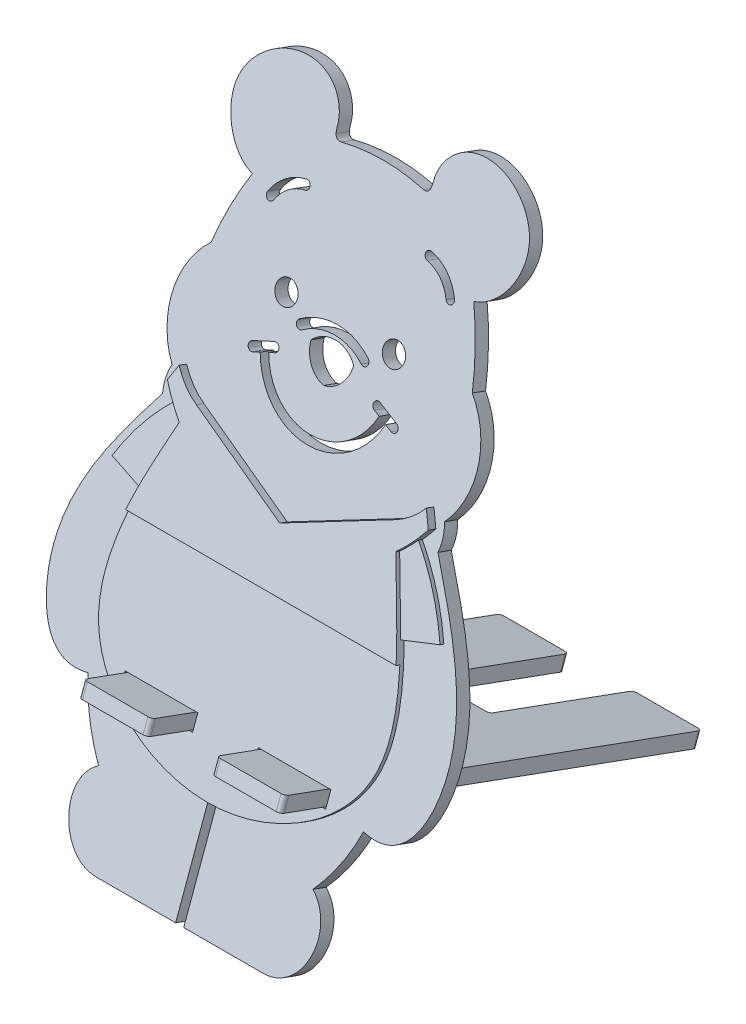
from build123d import *

# Parameters (mm, degrees)
EXTRUDE_1_DEPTH     = 3.5
FILLET_1_R          = 1
EXTRUDE_2_DEPTH     = 3.5
SKETCH_6_W          = 18
SKETCH_6_H          = 3.8
CUT_EXTRUDE_1_DEPTH = 189.194168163
SKETCH_8_R          = 2.733168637
CUT_EXTRUDE_3_DEPTH = 189.194168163
SKETCH_9_W          = 18
SKETCH_9_H          = 3.8
EXTRUDE_3_DEPTH     = 2
SKETCH_10_W         = 97.813131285
SKETCH_10_H         = 48.202311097
CUT_EXTRUDE_4_DEPTH = 1
EXTRUDE_5_DEPTH     = 1
CUT_EXTRUDE_5_DEPTH = 189.194168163


with BuildPart() as part:
    # Sketch 4 → Extrude 1 (new body)
    with BuildSketch(Plane(origin=(0, 32.139380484, -11.697777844), x_dir=(0, -0.34202014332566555, -0.9396926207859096), z_dir=(0, -0.9396926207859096, 0.34202014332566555))):
        Polygon((-16.030737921, -25), (93.969262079, -25), (93.969262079, -8), (55.969262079, -8), (55.969262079, 8), (93.969262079, 8), (93.969262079, 25), (-16.030737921, 25), (-16.030737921, 8), (0, 8), (0, -8), (-16.030737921, -8), align=None)
    extrude(amount=-EXTRUDE_1_DEPTH)

    # Fillet 1
    fillet_1_edges = [part.edges().sort_by_distance(p)[0] for p in [
        (-8, 39.266677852, 2.767653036),
        (-8, 33.783842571, -12.296313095),
        (8, 33.783842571, -12.296313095),
        (8, 39.266677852, 2.767653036),
        (25, 39.266677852, 2.767653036),
        (25, 1.644462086, -100.598535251),
        (8, 1.644462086, -100.598535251),
        (8, 14.641227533, -64.890215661),
        (-8, 14.641227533, -64.890215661),
        (-8, 1.644462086, -100.598535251),
        (-25, 1.644462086, -100.598535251),
        (-25, 39.266677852, 2.767653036),
    ]]
    fillet(fillet_1_edges, radius=FILLET_1_R)


with BuildPart() as body_2:
    # Sketch 5 → Extrude 2 (new body)
    with BuildSketch(Plane(origin=(0, 0, 0), x_dir=(0, 0.9396926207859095, -0.34202014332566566), z_dir=(0, -0.34202014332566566, -0.9396926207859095))):
        with BuildLine():
            Line((0, -20.658830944), (0, 20.658830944))
            add(Edge.make_bspline(
                [(18.883094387, 26.559790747), (13.900612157, 34.189685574), (0, 30.301471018), (0, 20.658830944)],
                knots=[0, 0, 0, 0, 1, 1, 1, 1], degree=3))
            ThreePointArc((18.883094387, 26.559790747), (25.771840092, 31.090114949), (33.434749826, 34.132888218))
            add(Edge.make_bspline(
                [(33.434749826, 34.132888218), (31.242065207, 43.568046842), (55.322218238, 55.363141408), (75.824445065, 41.637903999), (87.433341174, 34.132888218)],
                knots=[0, 0, 0, 0, 0.341997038, 1, 1, 1, 1], degree=3))
            ThreePointArc((87.433341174, 34.132888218), (90.334546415, 34.386280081), (93.180693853, 33.769316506))
            ThreePointArc((93.180693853, 33.769316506), (105.584070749, 37.86009381), (117.436898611, 32.374778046))
            ThreePointArc((117.436898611, 32.374778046), (125.335294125, 30.395019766), (132.921370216, 27.4360429))
            add(Edge.make_bspline(
                [(147.712565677, 11.753616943), (148.409020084, 11.947401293), (151.491552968, 11.674076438), (157.796485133, 15.441255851), (159.401807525, 27.199265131), (147.74878741, 40.745720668), (134.496232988, 33.363407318), (132.921370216, 27.4360429)],
                knots=[0.065882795, 0.065882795, 0.065882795, 0.065882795, 0.103766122, 0.230181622, 0.40921719, 0.672978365, 1, 1, 1, 1], degree=3))
            ThreePointArc((147.712565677, 11.753616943), (146.950478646, 11.176947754), (146.788573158, 10.235082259))
            ThreePointArc((146.788573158, 10.235082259), (147.847352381, 0), (146.788573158, -10.235082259))
            ThreePointArc((146.788573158, -10.235082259), (146.950478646, -11.176947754), (147.712565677, -11.753616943))
            add(Edge.make_bspline(
                [(147.712565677, -11.753616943), (148.409020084, -11.947401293), (151.491552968, -11.674076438), (157.796485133, -15.441255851), (159.401807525, -27.199265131), (147.74878741, -40.745720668), (134.496232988, -33.363407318), (132.921370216, -27.4360429)],
                knots=[0.065882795, 0.065882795, 0.065882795, 0.065882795, 0.103766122, 0.230181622, 0.40921719, 0.672978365, 1, 1, 1, 1], degree=3))
            ThreePointArc((132.921370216, -27.4360429), (125.335294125, -30.395019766), (117.436898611, -32.374778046))
            ThreePointArc((117.436898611, -32.374778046), (105.584070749, -37.86009381), (93.180693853, -33.769316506))
            ThreePointArc((93.180693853, -33.769316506), (90.334546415, -34.386280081), (87.433341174, -34.132888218))
            add(Edge.make_bspline(
                [(33.434749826, -34.132888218), (31.242065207, -43.568046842), (55.322218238, -55.363141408), (75.824445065, -41.637903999), (87.433341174, -34.132888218)],
                knots=[0, 0, 0, 0, 0.341997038, 1, 1, 1, 1], degree=3))
            ThreePointArc((33.434749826, -34.132888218), (25.771840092, -31.090114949), (18.883094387, -26.559790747))
            add(Edge.make_bspline(
                [(18.883094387, -26.559790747), (13.900612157, -34.189685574), (0, -30.301471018), (0, -20.658830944)],
                knots=[0, 0, 0, 0, 1, 1, 1, 1], degree=3))
        make_face()
    extrude(amount=-EXTRUDE_2_DEPTH)

    # Sketch 6 → Cut-Extrude 1 (cut, through all)
    with BuildSketch(Plane(origin=(0, 1.197070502, 3.288924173), x_dir=(1, 0, 0), z_dir=(0, 0.3420201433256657, 0.9396926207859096))):
        with Locations((16.5, 35.9)):
            Rectangle(SKETCH_6_W, SKETCH_6_H)
        with Locations((-16.5, 35.9)):
            Rectangle(SKETCH_6_W, SKETCH_6_H)
    extrude(amount=-CUT_EXTRUDE_1_DEPTH, mode=Mode.SUBTRACT)

    # Sketch 8 → Cut-Extrude 3 (cut, through all)
    with BuildSketch(Plane(origin=(0, 1.197070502, 3.288924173), x_dir=(1, 0, 0), z_dir=(0, 0.34202014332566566, 0.9396926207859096))):
        with Locations(Location((13.325965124, 116.351655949, 0), (0, 0, 270))):
            Circle(SKETCH_8_R)
        with Locations(Location((-13.325965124, 116.351655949, 0), (0, 0, 270))):
            Circle(SKETCH_8_R)
        with BuildLine():
            Line((15.54039874, 103.766951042), (17.166183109, 103.096780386))
            ThreePointArc((17.166183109, 103.096780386), (18.471819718, 103.640207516), (17.928392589, 104.945844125))
            Line((17.928392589, 104.945844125), (13.083731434, 106.942880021))
            ThreePointArc((13.083731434, 106.942880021), (11.778094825, 106.399452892), (12.321521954, 105.093816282))
            Line((12.321521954, 105.093816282), (13.688672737, 104.530257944))
            ThreePointArc((13.688672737, 104.530257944), (0, 94.788545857), (-13.688672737, 104.530257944))
            Line((-13.688672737, 104.530257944), (-12.321521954, 105.093816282))
            ThreePointArc((-12.321521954, 105.093816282), (-11.778094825, 106.399452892), (-13.083731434, 106.942880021))
            Line((-13.083731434, 106.942880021), (-17.928392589, 104.945844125))
            ThreePointArc((-17.928392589, 104.945844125), (-18.471819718, 103.640207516), (-17.166183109, 103.096780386))
            Line((-17.166183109, 103.096780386), (-15.54039874, 103.766951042))
            ThreePointArc((-15.54039874, 103.766951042), (0, 92.788545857), (15.54039874, 103.766951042))
        make_face()
        with BuildLine():
            ThreePointArc((23.171843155, 131.444993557), (20.012842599, 135.263788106), (15.466743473, 137.237479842))
            ThreePointArc((15.466743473, 137.237479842), (14.308268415, 136.426347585), (15.119400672, 135.267872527))
            ThreePointArc((15.119400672, 135.267872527), (18.811029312, 133.665149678), (21.376274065, 130.564123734))
            ThreePointArc((21.376274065, 130.564123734), (22.714493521, 130.106774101), (23.171843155, 131.444993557))
        make_face()
        with BuildLine():
            ThreePointArc((8.014486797, 113.167329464), (-0.493166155, 115.862313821), (-9.000819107, 113.167329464))
            ThreePointArc((-9.000819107, 113.167329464), (-9.242663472, 111.773948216), (-7.849282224, 111.532103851))
            ThreePointArc((-7.849282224, 111.532103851), (-0.493166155, 113.862313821), (6.862949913, 111.532103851))
            ThreePointArc((6.862949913, 111.532103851), (8.256331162, 111.773948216), (8.014486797, 113.167329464))
        make_face()
        with BuildLine():
            ThreePointArc((-5.329381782, 110.754175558), (0.035238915, 113.106605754), (5.327627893, 110.595888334))
            ThreePointArc((5.327627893, 110.595888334), (3.774647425, 106.51798492), (0, 104.328674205))
            ThreePointArc((0, 104.328674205), (-3.8255451, 106.578599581), (-5.329381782, 110.754175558))
        make_face()
        with BuildLine():
            ThreePointArc((-23.171843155, 131.444993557), (-20.012842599, 135.263788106), (-15.466743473, 137.237479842))
            ThreePointArc((-15.466743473, 137.237479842), (-14.308268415, 136.426347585), (-15.119400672, 135.267872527))
            ThreePointArc((-15.119400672, 135.267872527), (-18.811029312, 133.665149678), (-21.376274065, 130.564123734))
            ThreePointArc((-21.376274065, 130.564123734), (-22.714493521, 130.106774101), (-23.171843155, 131.444993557))
        make_face()
    extrude(amount=-CUT_EXTRUDE_3_DEPTH, mode=Mode.SUBTRACT)

    # Sketch 9 → Extrude 3 (add)
    # profile 1 of 2: a face of its own
    with BuildSketch(Plane(origin=(0, 1.197070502, 3.288924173), x_dir=(1, 0, 0), z_dir=(0, 0.34202014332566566, 0.9396926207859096))):
        with BuildLine():
            Line((24.680595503, 89.720574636), (0, 77.960504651))
            Line((0, 77.960504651), (0, 23.714593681))
            add(Edge.make_bspline(
                [(26.608694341, 84.403136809), (30.353199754, 73.236954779), (45.805619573, 40.98880702), (15.058520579, 23.839050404), (0, 23.714593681)],
                knots=[0, 0, 0, 0, 0.251794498, 0.49634767, 0.49634767, 0.49634767, 0.49634767], degree=3))
            ThreePointArc((26.608694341, 84.403136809), (29.664414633, 87.609694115), (32.334034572, 91.144176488))
            Line((32.334034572, 91.144176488), (30.655760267, 94.666333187))
            ThreePointArc((30.655760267, 94.666333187), (27.974829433, 91.822976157), (24.680595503, 89.720574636))
        make_face()
        with Locations((16.5, 35.9)):
            Rectangle(SKETCH_9_W, SKETCH_9_H, mode=Mode.SUBTRACT)
    # profile 2 of 2: a face of its own
    with BuildSketch(Plane(origin=(0, 1.197070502, 3.288924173), x_dir=(1, 0, 0), z_dir=(0, 0.34202014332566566, 0.9396926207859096))):
        with BuildLine():
            Line((0, 23.714593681), (0, 77.960504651))
            Line((0, 77.960504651), (-24.680595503, 89.720574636))
            ThreePointArc((-24.680595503, 89.720574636), (-27.974829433, 91.822976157), (-30.655760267, 94.666333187))
            Line((-30.655760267, 94.666333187), (-32.334034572, 91.144176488))
            ThreePointArc((-32.334034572, 91.144176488), (-29.990908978, 87.999262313), (-27.341750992, 85.107431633))
            add(Edge.make_bspline(
                [(0, 23.714593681), (-14.705684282, 23.593053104), (-45.469890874, 40.045520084), (-31.612038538, 73.304285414), (-27.341750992, 85.107431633)],
                knots=[0.49634767, 0.49634767, 0.49634767, 0.49634767, 0.735170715, 0.99892159, 0.99892159, 0.99892159, 0.99892159], degree=3))
        make_face()
        with Locations((-16.5, 35.9)):
            Rectangle(SKETCH_9_W, SKETCH_9_H, mode=Mode.SUBTRACT)
    extrude(amount=EXTRUDE_3_DEPTH)

    # Sketch 10 → Cut-Extrude 4 (cut)
    with BuildSketch(Plane(origin=(0, 1.881110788, 5.168309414), x_dir=(1, 0, 0), z_dir=(0, 0.3420201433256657, 0.9396926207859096))):
        with Locations((7.654880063, 41.23235069)):
            Rectangle(SKETCH_10_W, SKETCH_10_H)
    extrude(amount=-CUT_EXTRUDE_4_DEPTH, mode=Mode.SUBTRACT)

    # Sketch 11 → Extrude 5 (add)
    with BuildSketch(Plane(origin=(0, 1.197070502, 3.288924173), x_dir=(1, 0, 0), z_dir=(0, 0.34202014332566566, 0.9396926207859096))):
        with BuildLine():
            Line((30.60615273, 69.178511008), (40.656477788, 72.608861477))
            ThreePointArc((40.656477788, 72.608861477), (34.804367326, 82.583010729), (26.835446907, 90.963175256))
            ThreePointArc((26.835446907, 90.963175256), (25.782392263, 90.299611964), (24.680595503, 89.720574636))
            Line((24.680595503, 89.720574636), (0, 77.960504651))
            Line((0, 77.960504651), (-24.680595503, 89.720574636))
            ThreePointArc((-24.680595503, 89.720574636), (-25.782392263, 90.299611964), (-26.835446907, 90.963175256))
            ThreePointArc((-26.835446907, 90.963175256), (-34.804367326, 82.583010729), (-40.656477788, 72.608861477))
            Line((-40.656477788, 72.608861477), (-30.60615273, 69.178511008))
            Line((-30.60615273, 69.178511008), (30.60615273, 69.178511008))
        make_face()
    extrude(amount=EXTRUDE_5_DEPTH)

    # Sketch 12 → Cut-Extrude 5 (cut, through all)
    with BuildSketch(Plane(origin=(0, 1.197070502, 3.288924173), x_dir=(1, 0, 0), z_dir=(0, 0.34202014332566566, 0.9396926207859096))):
        with BuildLine():
            Line((-1, 23.718522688), (-1, -2.561378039))
            Line((-1, -2.561378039), (1, -2.561378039))
            Line((1, -2.561378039), (1, 23.735045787))
            add(Edge.make_bspline(
                [(1, 23.735045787), (0.666703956, 23.724182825), (-0.000131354, 23.71051261), (-0.666788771, 23.713163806), (-1, 23.718522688)],
                knots=[0.490934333, 0.490934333, 0.490934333, 0.490934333, 0.49634767, 0.501762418, 0.501762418, 0.501762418, 0.501762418], degree=3))
        make_face()
    extrude(amount=-CUT_EXTRUDE_5_DEPTH, mode=Mode.SUBTRACT)


solid = Compound([part.part, body_2.part])
